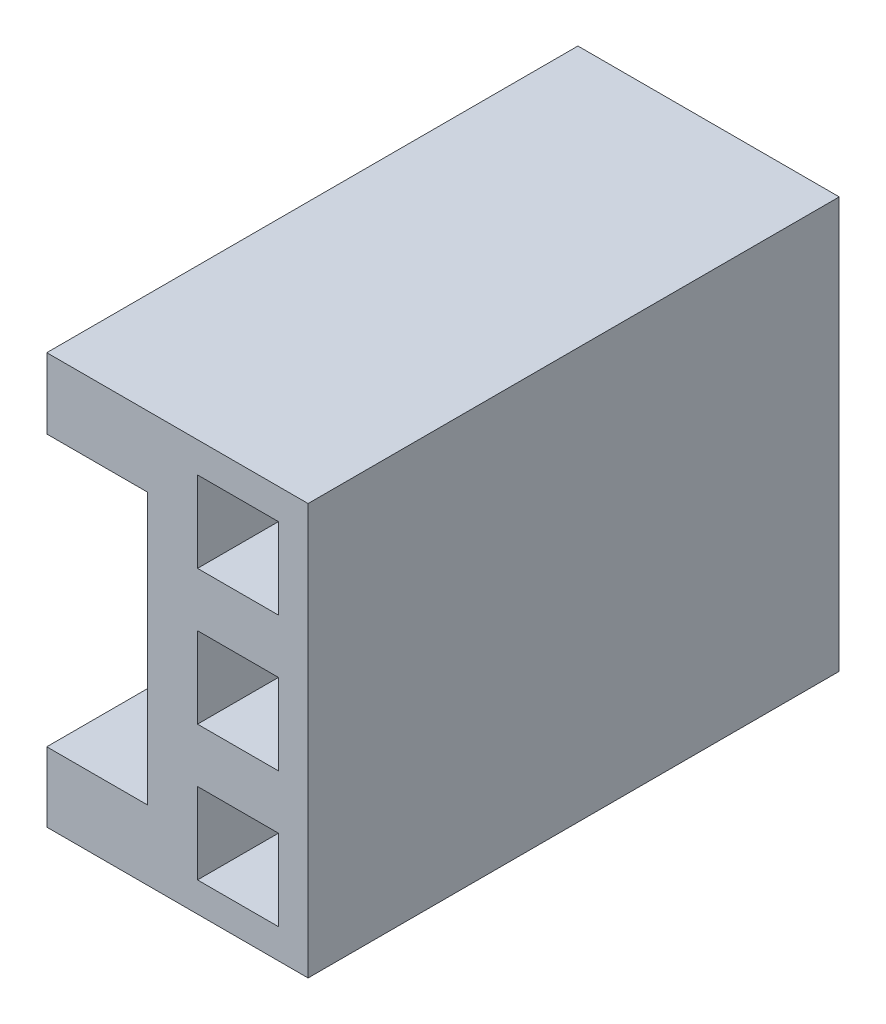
from build123d import *

# Parameters (mm, degrees)
SKETCH1_W          = 4.92
SKETCH1_H          = 7.736
SKETCH1_W_2        = 0.9
SKETCH1_H_2        = 5.1
SKETCH1_W_3        = 0.64
SKETCH1_H_3        = 0.64
EXTRUDE1_DEPTH     = 10
SKETCH3_W          = 1.524
SKETCH3_H          = 1.524
CUT_EXTRUDE1_DEPTH = 2.54
LPATTERN1_COUNT    = 3
LPATTERN1_PITCH    = 2.54
SKETCH4_W          = 10
SKETCH4_H          = 5.1
CUT_EXTRUDE2_DEPTH = 12.418834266
CUT_EXTRUDE3_DEPTH = 5.1


with BuildPart() as part:
    # Sketch1 → Extrude1 (new body)
    with BuildSketch(Plane.XY):
        with Locations((-1.14, 0.008)):
            Rectangle(SKETCH1_W, SKETCH1_H)
        with Locations((-2.15, 0)):
            Rectangle(SKETCH1_W_2, SKETCH1_H_2, mode=Mode.SUBTRACT)
        with Locations((0, 2.54)):
            Rectangle(SKETCH1_W_3, SKETCH1_H_3, mode=Mode.SUBTRACT)
        Rectangle(SKETCH1_W_3, SKETCH1_H_3, mode=Mode.SUBTRACT)
        with Locations((0, -2.54)):
            Rectangle(SKETCH1_W_3, SKETCH1_H_3, mode=Mode.SUBTRACT)
    extrude(amount=EXTRUDE1_DEPTH)

    # Sketch3 → Cut-Extrude1 (cut)
    with BuildSketch(Plane.XY.offset(10)):
        with Locations((0, -2.54)):
            Rectangle(SKETCH3_W, SKETCH3_H)
    cut_extrude1 = extrude(amount=-CUT_EXTRUDE1_DEPTH, mode=Mode.SUBTRACT)

    # LPattern1: Cut-Extrude1 ×3
    with Locations(*[(0, i * LPATTERN1_PITCH, 0) for i in range(1, LPATTERN1_COUNT)]):
        add(cut_extrude1, mode=Mode.SUBTRACT)

    # Sketch4 → Cut-Extrude2 (cut, through all)
    with BuildSketch(Plane(origin=(-2.6, 0, 0), x_dir=(0, 0, -1), z_dir=(1, 0, 0))):
        with Locations((-5, 0)):
            Rectangle(SKETCH4_W, SKETCH4_H)
    extrude(amount=-CUT_EXTRUDE2_DEPTH, mode=Mode.SUBTRACT)

    # Sketch5 → Cut-Extrude3 (cut)
    with BuildSketch(Plane.XZ.offset(-2.55)):
        Polygon((-1.45, 2.5), (-1.7, 2), (-1.7, 4), (-1.45, 3.5), align=None)
    extrude(amount=CUT_EXTRUDE3_DEPTH, mode=Mode.SUBTRACT)


solid = part.part
